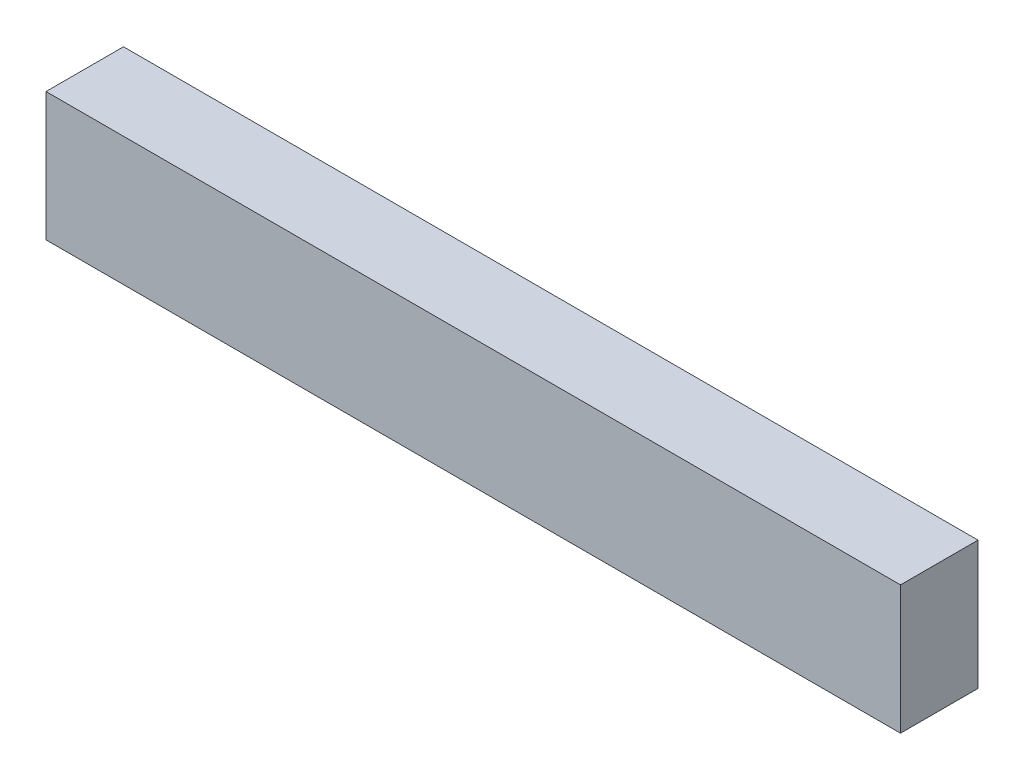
ISO-10303-21;
HEADER;
FILE_DESCRIPTION(('STEP AP214'),'2;1');
FILE_NAME('part.step','',(''),(''),'','','');
FILE_SCHEMA(('AUTOMOTIVE_DESIGN { 1 0 10303 214 1 1 1 1 }'));
ENDSEC;
DATA;
#1=APPLICATION_CONTEXT('core data for automotive mechanical design processes');
#2=APPLICATION_PROTOCOL_DEFINITION('international standard','automotive_design',2000,#1);
#3=PRODUCT_CONTEXT('',#1,'mechanical');
#4=PRODUCT('Part','Part','',(#3));
#5=PRODUCT_RELATED_PRODUCT_CATEGORY('part','',(#4));
#6=PRODUCT_DEFINITION_FORMATION('','',#4);
#7=PRODUCT_DEFINITION_CONTEXT('part definition',#1,'design');
#8=PRODUCT_DEFINITION('design','',#6,#7);
#9=PRODUCT_DEFINITION_SHAPE('','',#8);
#10=(LENGTH_UNIT() NAMED_UNIT(*) SI_UNIT(.MILLI.,.METRE.));
#11=(NAMED_UNIT(*) PLANE_ANGLE_UNIT() SI_UNIT($,.RADIAN.));
#12=(NAMED_UNIT(*) SI_UNIT($,.STERADIAN.) SOLID_ANGLE_UNIT());
#13=UNCERTAINTY_MEASURE_WITH_UNIT(LENGTH_MEASURE(1.E-05),#10,'distance_accuracy_value','');
#14=(GEOMETRIC_REPRESENTATION_CONTEXT(3) GLOBAL_UNCERTAINTY_ASSIGNED_CONTEXT((#13)) GLOBAL_UNIT_ASSIGNED_CONTEXT((#10,
#11,#12)) REPRESENTATION_CONTEXT('',''));
#15=CARTESIAN_POINT('',(0.,0.,0.));
#16=DIRECTION('',(0.,0.,1.));
#17=DIRECTION('',(1.,0.,0.));
#18=AXIS2_PLACEMENT_3D('',#15,#16,#17);
#19=CARTESIAN_POINT('',(0.,0.,38.));
#20=DIRECTION('',(1.,0.,0.));
#21=DIRECTION('',(0.,0.,-1.));
#22=AXIS2_PLACEMENT_3D('',#19,#20,#21);
#23=PLANE('',#22);
#24=DIRECTION('',(0.,-1.,0.));
#25=VECTOR('',#24,1.);
#26=CARTESIAN_POINT('',(0.,0.,0.));
#27=LINE('',#26,#25);
#28=CARTESIAN_POINT('',(0.,63.,0.));
#29=VERTEX_POINT('',#28);
#30=CARTESIAN_POINT('',(0.,0.,0.));
#31=VERTEX_POINT('',#30);
#32=EDGE_CURVE('E97',#29,#31,#27,.T.);
#33=ORIENTED_EDGE('',*,*,#32,.T.);
#34=DIRECTION('',(0.,0.,-1.));
#35=VECTOR('',#34,1.);
#36=CARTESIAN_POINT('',(0.,0.,38.));
#37=LINE('',#36,#35);
#38=CARTESIAN_POINT('',(0.,0.,38.));
#39=VERTEX_POINT('',#38);
#40=EDGE_CURVE('E11',#39,#31,#37,.T.);
#41=ORIENTED_EDGE('',*,*,#40,.F.);
#42=DIRECTION('',(0.,-1.,0.));
#43=VECTOR('',#42,1.);
#44=CARTESIAN_POINT('',(0.,0.,38.));
#45=LINE('',#44,#43);
#46=CARTESIAN_POINT('',(0.,63.,38.));
#47=VERTEX_POINT('',#46);
#48=EDGE_CURVE('E85',#47,#39,#45,.T.);
#49=ORIENTED_EDGE('',*,*,#48,.F.);
#50=DIRECTION('',(0.,0.,-1.));
#51=VECTOR('',#50,1.);
#52=CARTESIAN_POINT('',(0.,63.,38.));
#53=LINE('',#52,#51);
#54=EDGE_CURVE('E93',#47,#29,#53,.T.);
#55=ORIENTED_EDGE('',*,*,#54,.T.);
#56=EDGE_LOOP('',(#33,#41,#49,#55));
#57=FACE_BOUND('',#56,.T.);
#58=ADVANCED_FACE('F34',(#57),#23,.F.);
#59=CARTESIAN_POINT('',(0.,0.,38.));
#60=DIRECTION('',(0.,1.,0.));
#61=DIRECTION('',(0.,0.,1.));
#62=AXIS2_PLACEMENT_3D('',#59,#60,#61);
#63=PLANE('',#62);
#64=DIRECTION('',(1.,0.,0.));
#65=VECTOR('',#64,1.);
#66=CARTESIAN_POINT('',(0.,0.,0.));
#67=LINE('',#66,#65);
#68=CARTESIAN_POINT('',(419.,0.,0.));
#69=VERTEX_POINT('',#68);
#70=EDGE_CURVE('E89',#31,#69,#67,.T.);
#71=ORIENTED_EDGE('',*,*,#70,.T.);
#72=DIRECTION('',(0.,0.,-1.));
#73=VECTOR('',#72,1.);
#74=CARTESIAN_POINT('',(419.,0.,38.));
#75=LINE('',#74,#73);
#76=CARTESIAN_POINT('',(419.,0.,38.));
#77=VERTEX_POINT('',#76);
#78=EDGE_CURVE('E42',#77,#69,#75,.T.);
#79=ORIENTED_EDGE('',*,*,#78,.F.);
#80=DIRECTION('',(1.,0.,0.));
#81=VECTOR('',#80,1.);
#82=CARTESIAN_POINT('',(0.,0.,38.));
#83=LINE('',#82,#81);
#84=EDGE_CURVE('E80',#39,#77,#83,.T.);
#85=ORIENTED_EDGE('',*,*,#84,.F.);
#86=ORIENTED_EDGE('',*,*,#40,.T.);
#87=EDGE_LOOP('',(#71,#79,#85,#86));
#88=FACE_BOUND('',#87,.T.);
#89=ADVANCED_FACE('F88',(#88),#63,.F.);
#90=CARTESIAN_POINT('',(419.,0.,38.));
#91=DIRECTION('',(-1.,0.,0.));
#92=DIRECTION('',(0.,0.,1.));
#93=AXIS2_PLACEMENT_3D('',#90,#91,#92);
#94=PLANE('',#93);
#95=DIRECTION('',(0.,1.,0.));
#96=VECTOR('',#95,1.);
#97=CARTESIAN_POINT('',(419.,0.,0.));
#98=LINE('',#97,#96);
#99=CARTESIAN_POINT('',(419.,63.,0.));
#100=VERTEX_POINT('',#99);
#101=EDGE_CURVE('E67',#69,#100,#98,.T.);
#102=ORIENTED_EDGE('',*,*,#101,.T.);
#103=DIRECTION('',(0.,0.,-1.));
#104=VECTOR('',#103,1.);
#105=CARTESIAN_POINT('',(419.,63.,38.));
#106=LINE('',#105,#104);
#107=CARTESIAN_POINT('',(419.,63.,38.));
#108=VERTEX_POINT('',#107);
#109=EDGE_CURVE('E90',#108,#100,#106,.T.);
#110=ORIENTED_EDGE('',*,*,#109,.F.);
#111=DIRECTION('',(0.,1.,0.));
#112=VECTOR('',#111,1.);
#113=CARTESIAN_POINT('',(419.,0.,38.));
#114=LINE('',#113,#112);
#115=EDGE_CURVE('E83',#77,#108,#114,.T.);
#116=ORIENTED_EDGE('',*,*,#115,.F.);
#117=ORIENTED_EDGE('',*,*,#78,.T.);
#118=EDGE_LOOP('',(#102,#110,#116,#117));
#119=FACE_BOUND('',#118,.T.);
#120=ADVANCED_FACE('F91',(#119),#94,.F.);
#121=CARTESIAN_POINT('',(0.,63.,38.));
#122=DIRECTION('',(0.,-1.,0.));
#123=DIRECTION('',(0.,0.,-1.));
#124=AXIS2_PLACEMENT_3D('',#121,#122,#123);
#125=PLANE('',#124);
#126=DIRECTION('',(-1.,0.,0.));
#127=VECTOR('',#126,1.);
#128=CARTESIAN_POINT('',(0.,63.,0.));
#129=LINE('',#128,#127);
#130=EDGE_CURVE('E73',#100,#29,#129,.T.);
#131=ORIENTED_EDGE('',*,*,#130,.T.);
#132=ORIENTED_EDGE('',*,*,#54,.F.);
#133=DIRECTION('',(-1.,0.,0.));
#134=VECTOR('',#133,1.);
#135=CARTESIAN_POINT('',(0.,63.,38.));
#136=LINE('',#135,#134);
#137=EDGE_CURVE('E50',#108,#47,#136,.T.);
#138=ORIENTED_EDGE('',*,*,#137,.F.);
#139=ORIENTED_EDGE('',*,*,#109,.T.);
#140=EDGE_LOOP('',(#131,#132,#138,#139));
#141=FACE_BOUND('',#140,.T.);
#142=ADVANCED_FACE('F104',(#141),#125,.F.);
#143=CARTESIAN_POINT('',(0.,0.,38.));
#144=DIRECTION('',(0.,0.,-1.));
#145=DIRECTION('',(-1.,0.,0.));
#146=AXIS2_PLACEMENT_3D('',#143,#144,#145);
#147=PLANE('',#146);
#148=ORIENTED_EDGE('',*,*,#48,.T.);
#149=ORIENTED_EDGE('',*,*,#84,.T.);
#150=ORIENTED_EDGE('',*,*,#115,.T.);
#151=ORIENTED_EDGE('',*,*,#137,.T.);
#152=EDGE_LOOP('',(#148,#149,#150,#151));
#153=FACE_BOUND('',#152,.T.);
#154=ADVANCED_FACE('F81',(#153),#147,.F.);
#155=CARTESIAN_POINT('',(0.,0.,0.));
#156=DIRECTION('',(0.,0.,-1.));
#157=DIRECTION('',(-1.,0.,0.));
#158=AXIS2_PLACEMENT_3D('',#155,#156,#157);
#159=PLANE('',#158);
#160=ORIENTED_EDGE('',*,*,#32,.F.);
#161=ORIENTED_EDGE('',*,*,#130,.F.);
#162=ORIENTED_EDGE('',*,*,#101,.F.);
#163=ORIENTED_EDGE('',*,*,#70,.F.);
#164=EDGE_LOOP('',(#160,#161,#162,#163));
#165=FACE_BOUND('',#164,.T.);
#166=ADVANCED_FACE('F107',(#165),#159,.T.);
#167=CLOSED_SHELL('',(#58,#89,#120,#142,#154,#166));
#168=MANIFOLD_SOLID_BREP('B2',#167);
#169=ADVANCED_BREP_SHAPE_REPRESENTATION('',(#18,#168),#14);
#170=SHAPE_DEFINITION_REPRESENTATION(#9,#169);
ENDSEC;
END-ISO-10303-21;
